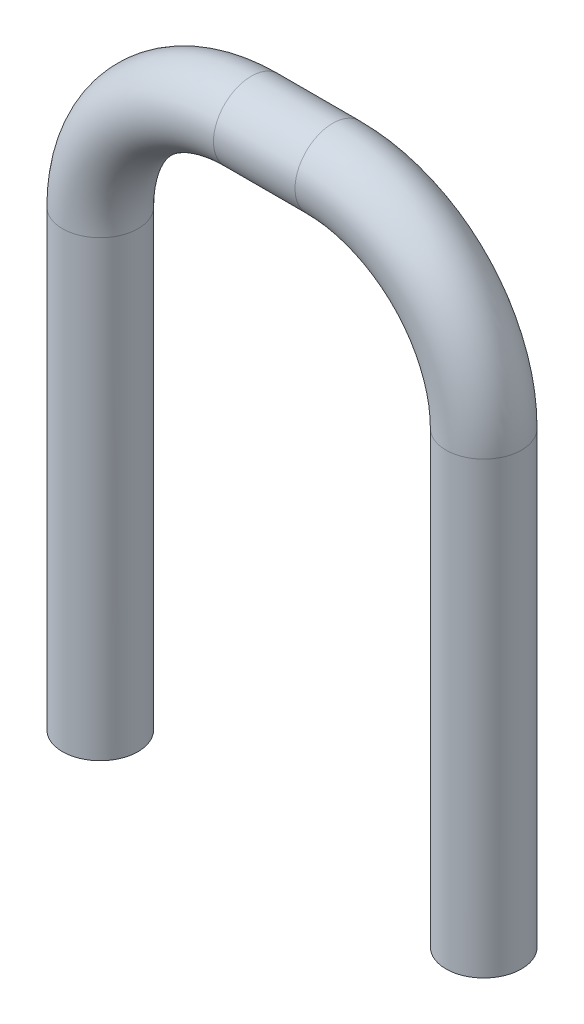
from build123d import *

# Parameters (mm, degrees)
ESQUISSE2_R = 0.25


with BuildPart() as part:
    # Balayage1: sweep along a path in Esquisse1
    with BuildLine(Plane.XY) as balayage1_path:
        Line((0, 0), (0, 3))
        ThreePointArc((0, 3), (0.292893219, 3.707106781), (1, 4))
        Line((1, 4), (1.54, 4))
        ThreePointArc((1.54, 4), (2.247106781, 3.707106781), (2.54, 3))
        Line((2.54, 3), (2.54, 0.02366985))
    # Esquisse2 → Balayage1 (sweep)
    with BuildSketch(Plane(origin=(0, 0, 0), x_dir=(1, 0, 0), z_dir=(0, 1, 0))):
        Circle(ESQUISSE2_R)
    sweep(path=balayage1_path.line)


solid = part.part
